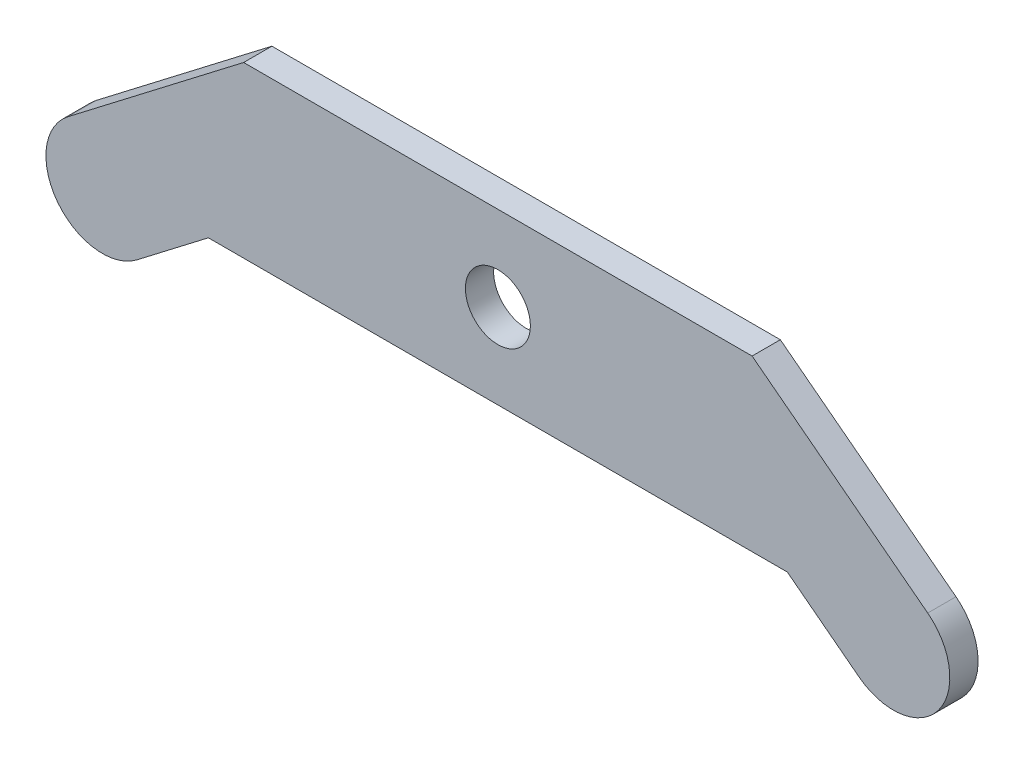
ISO-10303-21;
HEADER;
FILE_DESCRIPTION(('STEP AP214'),'2;1');
FILE_NAME('part.step','',(''),(''),'','','');
FILE_SCHEMA(('AUTOMOTIVE_DESIGN { 1 0 10303 214 1 1 1 1 }'));
ENDSEC;
DATA;
#1=APPLICATION_CONTEXT('core data for automotive mechanical design processes');
#2=APPLICATION_PROTOCOL_DEFINITION('international standard','automotive_design',2000,#1);
#3=PRODUCT_CONTEXT('',#1,'mechanical');
#4=PRODUCT('Part','Part','',(#3));
#5=PRODUCT_RELATED_PRODUCT_CATEGORY('part','',(#4));
#6=PRODUCT_DEFINITION_FORMATION('','',#4);
#7=PRODUCT_DEFINITION_CONTEXT('part definition',#1,'design');
#8=PRODUCT_DEFINITION('design','',#6,#7);
#9=PRODUCT_DEFINITION_SHAPE('','',#8);
#10=(LENGTH_UNIT() NAMED_UNIT(*) SI_UNIT(.MILLI.,.METRE.));
#11=(NAMED_UNIT(*) PLANE_ANGLE_UNIT() SI_UNIT($,.RADIAN.));
#12=(NAMED_UNIT(*) SI_UNIT($,.STERADIAN.) SOLID_ANGLE_UNIT());
#13=UNCERTAINTY_MEASURE_WITH_UNIT(LENGTH_MEASURE(1.E-05),#10,'distance_accuracy_value','');
#14=(GEOMETRIC_REPRESENTATION_CONTEXT(3) GLOBAL_UNCERTAINTY_ASSIGNED_CONTEXT((#13)) GLOBAL_UNIT_ASSIGNED_CONTEXT((#10,
#11,#12)) REPRESENTATION_CONTEXT('',''));
#15=CARTESIAN_POINT('',(0.,0.,0.));
#16=DIRECTION('',(0.,0.,1.));
#17=DIRECTION('',(1.,0.,0.));
#18=AXIS2_PLACEMENT_3D('',#15,#16,#17);
#19=CARTESIAN_POINT('',(70.,-31.7878988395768,2.5));
#20=DIRECTION('',(0.,0.,-1.));
#21=DIRECTION('',(-1.,0.,0.));
#22=AXIS2_PLACEMENT_3D('',#19,#20,#21);
#23=PLANE('',#22);
#24=DIRECTION('',(-0.793353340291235,-0.608761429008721,0.));
#25=VECTOR('',#24,1.);
#26=CARTESIAN_POINT('',(-76.0876142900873,-23.8543654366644,2.5));
#27=LINE('',#26,#25);
#28=CARTESIAN_POINT('',(-45.,0.,2.5));
#29=VERTEX_POINT('',#28);
#30=CARTESIAN_POINT('',(-76.0876142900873,-23.8543654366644,2.5));
#31=VERTEX_POINT('',#30);
#32=EDGE_CURVE('E144',#29,#31,#27,.T.);
#33=ORIENTED_EDGE('',*,*,#32,.T.);
#34=CARTESIAN_POINT('',(-70.,-31.7878988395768,2.5));
#35=DIRECTION('',(0.,0.,1.));
#36=DIRECTION('',(-1.,0.,0.));
#37=AXIS2_PLACEMENT_3D('',#34,#35,#36);
#38=CIRCLE('',#37,10.0000000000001);
#39=CARTESIAN_POINT('',(-63.9123857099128,-39.7214322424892,2.5));
#40=VERTEX_POINT('',#39);
#41=EDGE_CURVE('E92',#31,#40,#38,.T.);
#42=ORIENTED_EDGE('',*,*,#41,.T.);
#43=DIRECTION('',(0.79335334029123,0.608761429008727,0.));
#44=VECTOR('',#43,1.);
#45=CARTESIAN_POINT('',(-51.2431685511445,-30.,2.5));
#46=LINE('',#45,#44);
#47=CARTESIAN_POINT('',(-51.2431685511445,-30.,2.5));
#48=VERTEX_POINT('',#47);
#49=EDGE_CURVE('E159',#40,#48,#46,.T.);
#50=ORIENTED_EDGE('',*,*,#49,.T.);
#51=DIRECTION('',(1.,0.,0.));
#52=VECTOR('',#51,1.);
#53=CARTESIAN_POINT('',(51.2431685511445,-30.,2.5));
#54=LINE('',#53,#52);
#55=CARTESIAN_POINT('',(51.2431685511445,-30.,2.5));
#56=VERTEX_POINT('',#55);
#57=EDGE_CURVE('E172',#48,#56,#54,.T.);
#58=ORIENTED_EDGE('',*,*,#57,.T.);
#59=DIRECTION('',(0.79335334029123,-0.608761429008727,0.));
#60=VECTOR('',#59,1.);
#61=CARTESIAN_POINT('',(63.9123857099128,-39.7214322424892,2.5));
#62=LINE('',#61,#60);
#63=CARTESIAN_POINT('',(63.9123857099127,-39.7214322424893,2.5));
#64=VERTEX_POINT('',#63);
#65=EDGE_CURVE('E111',#56,#64,#62,.T.);
#66=ORIENTED_EDGE('',*,*,#65,.T.);
#67=CARTESIAN_POINT('',(70.,-31.7878988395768,2.5));
#68=DIRECTION('',(0.,0.,1.));
#69=DIRECTION('',(-1.,0.,0.));
#70=AXIS2_PLACEMENT_3D('',#67,#68,#69);
#71=CIRCLE('',#70,10.0000000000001);
#72=CARTESIAN_POINT('',(76.0876142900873,-23.8543654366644,2.5));
#73=VERTEX_POINT('',#72);
#74=EDGE_CURVE('E105',#64,#73,#71,.T.);
#75=ORIENTED_EDGE('',*,*,#74,.T.);
#76=DIRECTION('',(-0.793353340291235,0.608761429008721,0.));
#77=VECTOR('',#76,1.);
#78=CARTESIAN_POINT('',(45.,0.,2.5));
#79=LINE('',#78,#77);
#80=CARTESIAN_POINT('',(45.,0.,2.5));
#81=VERTEX_POINT('',#80);
#82=EDGE_CURVE('E109',#73,#81,#79,.T.);
#83=ORIENTED_EDGE('',*,*,#82,.T.);
#84=DIRECTION('',(-1.,0.,0.));
#85=VECTOR('',#84,1.);
#86=CARTESIAN_POINT('',(-45.,0.,2.5));
#87=LINE('',#86,#85);
#88=EDGE_CURVE('E49',#81,#29,#87,.T.);
#89=ORIENTED_EDGE('',*,*,#88,.T.);
#90=EDGE_LOOP('',(#33,#42,#50,#58,#66,#75,#83,#89));
#91=FACE_BOUND('',#90,.T.);
#92=CARTESIAN_POINT('',(0.,-15.,2.5));
#93=DIRECTION('',(0.,0.,1.));
#94=DIRECTION('',(1.,0.,0.));
#95=AXIS2_PLACEMENT_3D('',#92,#93,#94);
#96=CIRCLE('',#95,5.75);
#97=CARTESIAN_POINT('',(5.75,-15.,2.5));
#98=VERTEX_POINT('',#97);
#99=EDGE_CURVE('E133',#98,#98,#96,.T.);
#100=ORIENTED_EDGE('',*,*,#99,.F.);
#101=EDGE_LOOP('',(#100));
#102=FACE_BOUND('',#101,.T.);
#103=ADVANCED_FACE('F32',(#91,#102),#23,.F.);
#104=CARTESIAN_POINT('',(70.,-31.7878988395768,-2.5));
#105=DIRECTION('',(0.,0.,-1.));
#106=DIRECTION('',(-1.,0.,0.));
#107=AXIS2_PLACEMENT_3D('',#104,#105,#106);
#108=PLANE('',#107);
#109=DIRECTION('',(-0.793353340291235,-0.608761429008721,0.));
#110=VECTOR('',#109,1.);
#111=CARTESIAN_POINT('',(-76.0876142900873,-23.8543654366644,-2.5));
#112=LINE('',#111,#110);
#113=CARTESIAN_POINT('',(-45.,0.,-2.5));
#114=VERTEX_POINT('',#113);
#115=CARTESIAN_POINT('',(-76.0876142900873,-23.8543654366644,-2.5));
#116=VERTEX_POINT('',#115);
#117=EDGE_CURVE('E129',#114,#116,#112,.T.);
#118=ORIENTED_EDGE('',*,*,#117,.F.);
#119=DIRECTION('',(-1.,0.,0.));
#120=VECTOR('',#119,1.);
#121=CARTESIAN_POINT('',(-45.,0.,-2.5));
#122=LINE('',#121,#120);
#123=CARTESIAN_POINT('',(45.,0.,-2.5));
#124=VERTEX_POINT('',#123);
#125=EDGE_CURVE('E84',#124,#114,#122,.T.);
#126=ORIENTED_EDGE('',*,*,#125,.F.);
#127=DIRECTION('',(-0.793353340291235,0.608761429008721,0.));
#128=VECTOR('',#127,1.);
#129=CARTESIAN_POINT('',(45.,0.,-2.5));
#130=LINE('',#129,#128);
#131=CARTESIAN_POINT('',(76.0876142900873,-23.8543654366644,-2.5));
#132=VERTEX_POINT('',#131);
#133=EDGE_CURVE('E78',#132,#124,#130,.T.);
#134=ORIENTED_EDGE('',*,*,#133,.F.);
#135=CARTESIAN_POINT('',(70.,-31.7878988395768,-2.5));
#136=DIRECTION('',(0.,0.,1.));
#137=DIRECTION('',(-1.,0.,0.));
#138=AXIS2_PLACEMENT_3D('',#135,#136,#137);
#139=CIRCLE('',#138,10.0000000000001);
#140=CARTESIAN_POINT('',(63.9123857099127,-39.7214322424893,-2.5));
#141=VERTEX_POINT('',#140);
#142=EDGE_CURVE('E119',#141,#132,#139,.T.);
#143=ORIENTED_EDGE('',*,*,#142,.F.);
#144=DIRECTION('',(0.79335334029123,-0.608761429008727,0.));
#145=VECTOR('',#144,1.);
#146=CARTESIAN_POINT('',(63.9123857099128,-39.7214322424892,-2.5));
#147=LINE('',#146,#145);
#148=CARTESIAN_POINT('',(51.2431685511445,-30.,-2.5));
#149=VERTEX_POINT('',#148);
#150=EDGE_CURVE('E139',#149,#141,#147,.T.);
#151=ORIENTED_EDGE('',*,*,#150,.F.);
#152=DIRECTION('',(1.,0.,0.));
#153=VECTOR('',#152,1.);
#154=CARTESIAN_POINT('',(51.2431685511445,-30.,-2.5));
#155=LINE('',#154,#153);
#156=CARTESIAN_POINT('',(-51.2431685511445,-30.,-2.5));
#157=VERTEX_POINT('',#156);
#158=EDGE_CURVE('E137',#157,#149,#155,.T.);
#159=ORIENTED_EDGE('',*,*,#158,.F.);
#160=DIRECTION('',(0.79335334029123,0.608761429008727,0.));
#161=VECTOR('',#160,1.);
#162=CARTESIAN_POINT('',(-51.2431685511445,-30.,-2.5));
#163=LINE('',#162,#161);
#164=CARTESIAN_POINT('',(-63.9123857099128,-39.7214322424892,-2.5));
#165=VERTEX_POINT('',#164);
#166=EDGE_CURVE('E135',#165,#157,#163,.T.);
#167=ORIENTED_EDGE('',*,*,#166,.F.);
#168=CARTESIAN_POINT('',(-70.,-31.7878988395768,-2.5));
#169=DIRECTION('',(0.,0.,1.));
#170=DIRECTION('',(-1.,0.,0.));
#171=AXIS2_PLACEMENT_3D('',#168,#169,#170);
#172=CIRCLE('',#171,10.0000000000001);
#173=EDGE_CURVE('E132',#116,#165,#172,.T.);
#174=ORIENTED_EDGE('',*,*,#173,.F.);
#175=EDGE_LOOP('',(#118,#126,#134,#143,#151,#159,#167,#174));
#176=FACE_BOUND('',#175,.T.);
#177=CARTESIAN_POINT('',(0.,-15.,-2.5));
#178=DIRECTION('',(0.,0.,1.));
#179=DIRECTION('',(1.,0.,0.));
#180=AXIS2_PLACEMENT_3D('',#177,#178,#179);
#181=CIRCLE('',#180,5.75);
#182=CARTESIAN_POINT('',(5.75,-15.,-2.5));
#183=VERTEX_POINT('',#182);
#184=EDGE_CURVE('E178',#183,#183,#181,.T.);
#185=ORIENTED_EDGE('',*,*,#184,.T.);
#186=EDGE_LOOP('',(#185));
#187=FACE_BOUND('',#186,.T.);
#188=ADVANCED_FACE('F163',(#176,#187),#108,.T.);
#189=CARTESIAN_POINT('',(-76.0876142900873,-23.8543654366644,2.5));
#190=DIRECTION('',(0.608761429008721,-0.793353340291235,0.));
#191=DIRECTION('',(0.793353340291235,0.608761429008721,0.));
#192=AXIS2_PLACEMENT_3D('',#189,#190,#191);
#193=PLANE('',#192);
#194=ORIENTED_EDGE('',*,*,#117,.T.);
#195=DIRECTION('',(0.,0.,-1.));
#196=VECTOR('',#195,1.);
#197=CARTESIAN_POINT('',(-76.0876142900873,-23.8543654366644,2.5));
#198=LINE('',#197,#196);
#199=EDGE_CURVE('E11',#31,#116,#198,.T.);
#200=ORIENTED_EDGE('',*,*,#199,.F.);
#201=ORIENTED_EDGE('',*,*,#32,.F.);
#202=DIRECTION('',(0.,0.,-1.));
#203=VECTOR('',#202,1.);
#204=CARTESIAN_POINT('',(-45.,0.,2.5));
#205=LINE('',#204,#203);
#206=EDGE_CURVE('E125',#29,#114,#205,.T.);
#207=ORIENTED_EDGE('',*,*,#206,.T.);
#208=EDGE_LOOP('',(#194,#200,#201,#207));
#209=FACE_BOUND('',#208,.T.);
#210=ADVANCED_FACE('F34',(#209),#193,.F.);
#211=CARTESIAN_POINT('',(-70.,-31.7878988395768,2.5));
#212=DIRECTION('',(0.,0.,-1.));
#213=DIRECTION('',(-1.,0.,0.));
#214=AXIS2_PLACEMENT_3D('',#211,#212,#213);
#215=CYLINDRICAL_SURFACE('',#214,10.0000000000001);
#216=ORIENTED_EDGE('',*,*,#173,.T.);
#217=DIRECTION('',(0.,0.,-1.));
#218=VECTOR('',#217,1.);
#219=CARTESIAN_POINT('',(-63.9123857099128,-39.7214322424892,2.5));
#220=LINE('',#219,#218);
#221=EDGE_CURVE('E41',#40,#165,#220,.T.);
#222=ORIENTED_EDGE('',*,*,#221,.F.);
#223=ORIENTED_EDGE('',*,*,#41,.F.);
#224=ORIENTED_EDGE('',*,*,#199,.T.);
#225=EDGE_LOOP('',(#216,#222,#223,#224));
#226=FACE_BOUND('',#225,.T.);
#227=ADVANCED_FACE('F206',(#226),#215,.T.);
#228=CARTESIAN_POINT('',(-51.2431685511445,-30.,2.5));
#229=DIRECTION('',(-0.608761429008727,0.79335334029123,0.));
#230=DIRECTION('',(-0.79335334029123,-0.608761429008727,0.));
#231=AXIS2_PLACEMENT_3D('',#228,#229,#230);
#232=PLANE('',#231);
#233=ORIENTED_EDGE('',*,*,#166,.T.);
#234=DIRECTION('',(0.,0.,-1.));
#235=VECTOR('',#234,1.);
#236=CARTESIAN_POINT('',(-51.2431685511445,-30.,2.5));
#237=LINE('',#236,#235);
#238=EDGE_CURVE('E151',#48,#157,#237,.T.);
#239=ORIENTED_EDGE('',*,*,#238,.F.);
#240=ORIENTED_EDGE('',*,*,#49,.F.);
#241=ORIENTED_EDGE('',*,*,#221,.T.);
#242=EDGE_LOOP('',(#233,#239,#240,#241));
#243=FACE_BOUND('',#242,.T.);
#244=ADVANCED_FACE('F157',(#243),#232,.F.);
#245=CARTESIAN_POINT('',(51.2431685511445,-30.,2.5));
#246=DIRECTION('',(0.,1.,0.));
#247=DIRECTION('',(-1.,0.,0.));
#248=AXIS2_PLACEMENT_3D('',#245,#246,#247);
#249=PLANE('',#248);
#250=ORIENTED_EDGE('',*,*,#158,.T.);
#251=DIRECTION('',(0.,0.,-1.));
#252=VECTOR('',#251,1.);
#253=CARTESIAN_POINT('',(51.2431685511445,-30.,2.5));
#254=LINE('',#253,#252);
#255=EDGE_CURVE('E148',#56,#149,#254,.T.);
#256=ORIENTED_EDGE('',*,*,#255,.F.);
#257=ORIENTED_EDGE('',*,*,#57,.F.);
#258=ORIENTED_EDGE('',*,*,#238,.T.);
#259=EDGE_LOOP('',(#250,#256,#257,#258));
#260=FACE_BOUND('',#259,.T.);
#261=ADVANCED_FACE('F168',(#260),#249,.F.);
#262=CARTESIAN_POINT('',(63.9123857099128,-39.7214322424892,2.5));
#263=DIRECTION('',(0.608761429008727,0.79335334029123,0.));
#264=DIRECTION('',(-0.79335334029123,0.608761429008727,0.));
#265=AXIS2_PLACEMENT_3D('',#262,#263,#264);
#266=PLANE('',#265);
#267=ORIENTED_EDGE('',*,*,#150,.T.);
#268=DIRECTION('',(0.,0.,-1.));
#269=VECTOR('',#268,1.);
#270=CARTESIAN_POINT('',(63.9123857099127,-39.7214322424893,2.5));
#271=LINE('',#270,#269);
#272=EDGE_CURVE('E120',#64,#141,#271,.T.);
#273=ORIENTED_EDGE('',*,*,#272,.F.);
#274=ORIENTED_EDGE('',*,*,#65,.F.);
#275=ORIENTED_EDGE('',*,*,#255,.T.);
#276=EDGE_LOOP('',(#267,#273,#274,#275));
#277=FACE_BOUND('',#276,.T.);
#278=ADVANCED_FACE('F171',(#277),#266,.F.);
#279=CARTESIAN_POINT('',(70.,-31.7878988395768,2.5));
#280=DIRECTION('',(0.,0.,-1.));
#281=DIRECTION('',(-1.,0.,0.));
#282=AXIS2_PLACEMENT_3D('',#279,#280,#281);
#283=CYLINDRICAL_SURFACE('',#282,10.0000000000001);
#284=ORIENTED_EDGE('',*,*,#142,.T.);
#285=DIRECTION('',(0.,0.,-1.));
#286=VECTOR('',#285,1.);
#287=CARTESIAN_POINT('',(76.0876142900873,-23.8543654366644,2.5));
#288=LINE('',#287,#286);
#289=EDGE_CURVE('E116',#73,#132,#288,.T.);
#290=ORIENTED_EDGE('',*,*,#289,.F.);
#291=ORIENTED_EDGE('',*,*,#74,.F.);
#292=ORIENTED_EDGE('',*,*,#272,.T.);
#293=EDGE_LOOP('',(#284,#290,#291,#292));
#294=FACE_BOUND('',#293,.T.);
#295=ADVANCED_FACE('F117',(#294),#283,.T.);
#296=CARTESIAN_POINT('',(45.,0.,2.5));
#297=DIRECTION('',(-0.608761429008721,-0.793353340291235,0.));
#298=DIRECTION('',(0.793353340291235,-0.608761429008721,0.));
#299=AXIS2_PLACEMENT_3D('',#296,#297,#298);
#300=PLANE('',#299);
#301=ORIENTED_EDGE('',*,*,#133,.T.);
#302=DIRECTION('',(0.,0.,-1.));
#303=VECTOR('',#302,1.);
#304=CARTESIAN_POINT('',(45.,0.,2.5));
#305=LINE('',#304,#303);
#306=EDGE_CURVE('E121',#81,#124,#305,.T.);
#307=ORIENTED_EDGE('',*,*,#306,.F.);
#308=ORIENTED_EDGE('',*,*,#82,.F.);
#309=ORIENTED_EDGE('',*,*,#289,.T.);
#310=EDGE_LOOP('',(#301,#307,#308,#309));
#311=FACE_BOUND('',#310,.T.);
#312=ADVANCED_FACE('F123',(#311),#300,.F.);
#313=CARTESIAN_POINT('',(-45.,0.,2.5));
#314=DIRECTION('',(0.,-1.,0.));
#315=DIRECTION('',(1.,0.,0.));
#316=AXIS2_PLACEMENT_3D('',#313,#314,#315);
#317=PLANE('',#316);
#318=ORIENTED_EDGE('',*,*,#125,.T.);
#319=ORIENTED_EDGE('',*,*,#206,.F.);
#320=ORIENTED_EDGE('',*,*,#88,.F.);
#321=ORIENTED_EDGE('',*,*,#306,.T.);
#322=EDGE_LOOP('',(#318,#319,#320,#321));
#323=FACE_BOUND('',#322,.T.);
#324=ADVANCED_FACE('F194',(#323),#317,.F.);
#325=CARTESIAN_POINT('',(0.,-15.,2.5));
#326=DIRECTION('',(0.,0.,-1.));
#327=DIRECTION('',(-1.,0.,0.));
#328=AXIS2_PLACEMENT_3D('',#325,#326,#327);
#329=CYLINDRICAL_SURFACE('',#328,5.75);
#330=ORIENTED_EDGE('',*,*,#99,.T.);
#331=EDGE_LOOP('',(#330));
#332=FACE_BOUND('',#331,.T.);
#333=ORIENTED_EDGE('',*,*,#184,.F.);
#334=EDGE_LOOP('',(#333));
#335=FACE_BOUND('',#334,.T.);
#336=ADVANCED_FACE('F184',(#332,#335),#329,.F.);
#337=CLOSED_SHELL('',(#103,#188,#210,#227,#244,#261,#278,#295,#312,#324,#336));
#338=MANIFOLD_SOLID_BREP('B2',#337);
#339=ADVANCED_BREP_SHAPE_REPRESENTATION('',(#18,#338),#14);
#340=SHAPE_DEFINITION_REPRESENTATION(#9,#339);
ENDSEC;
END-ISO-10303-21;
